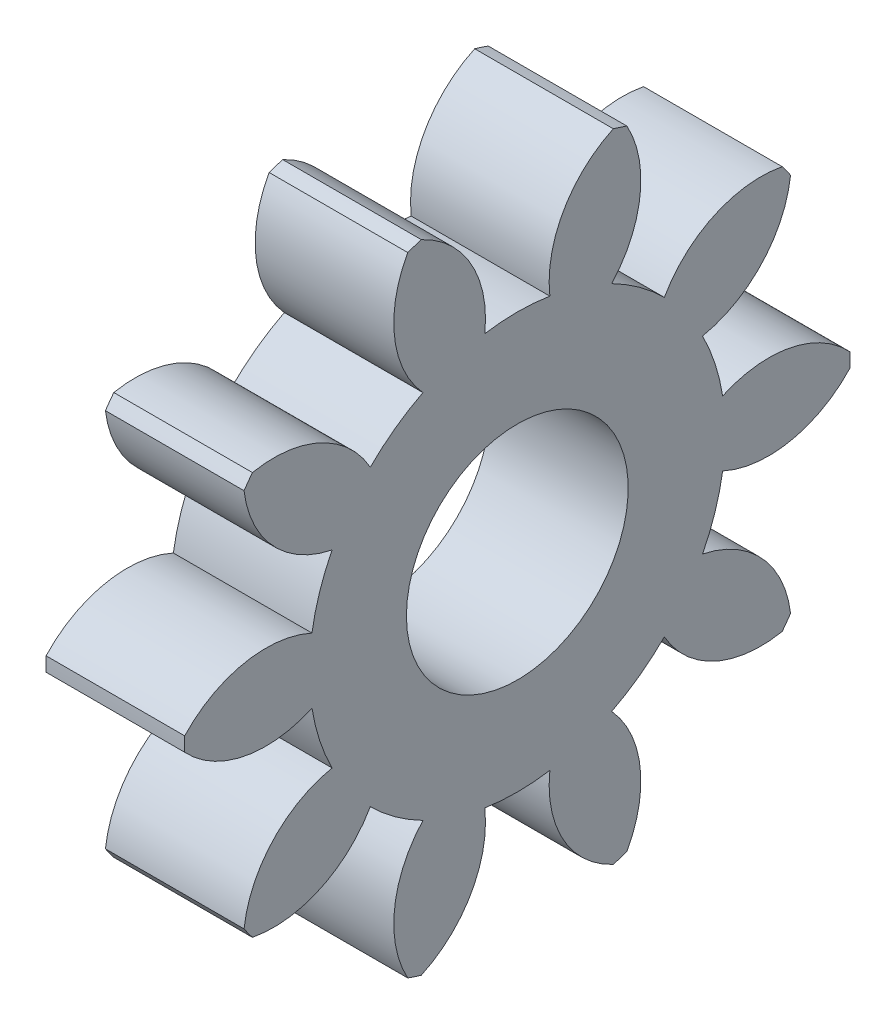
from build123d import *

# Parameters (mm, degrees)
BASPROSKE_W     = 5
BASPROSKE_H     = 12
TOOTHCUT_DEPTH  = 18.691806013
TEETHCUTS_COUNT = 10
TEETHCUTS_ANGLE = 324
BORSKE_R        = 4
BORE_DEPTH      = 50.0000508


with BuildPart() as part:
    # BasProSke → Base-Revolve (revolve)
    with BuildSketch(Plane(origin=(0, 0, 0), x_dir=(1, 0, 0), z_dir=(0, 1, 0)), mode=Mode.PRIVATE) as base_revolve_sk:
        with Locations((2.5, 6)):
            Rectangle(BASPROSKE_W, BASPROSKE_H)
    revolve(base_revolve_sk.sketch.rotate(Axis((-10, 0, 0), (1, 0, 0)), 180), axis=Axis((-10, 0, 0), (1, 0, 0)))

    # TooCutSke → ToothCut (cut, through all)
    with BuildSketch(Plane(origin=(0, 0, 0), x_dir=(0, 0, -1), z_dir=(1, 0, 0))):
        with BuildLine():
            ThreePointArc((1.173662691, 7.406586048), (0, 7.499), (-1.173662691, 7.406586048))
            ThreePointArc((-1.173662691, 7.406586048), (-1.668191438, 9.834565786), (-3.497907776, 11.50542856))
            ThreePointArc((-3.497907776, 11.50542856), (0, 12.0254), (3.497907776, 11.50542856))
            ThreePointArc((3.497907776, 11.50542856), (1.668191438, 9.834565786), (1.173662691, 7.406586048))
        make_face()
    toothcut = extrude(amount=TOOTHCUT_DEPTH, mode=Mode.SUBTRACT)

    # TeethCuts: ToothCut ×10 about axis
    teethcuts_axis = Axis((-10, 0, 0), (1, 0, 0))
    for i in range(1, TEETHCUTS_COUNT):
        add(toothcut.rotate(teethcuts_axis, i * TEETHCUTS_ANGLE / (TEETHCUTS_COUNT - 1)), mode=Mode.SUBTRACT)

    # BorSke → Bore (cut, symmetric)
    with BuildSketch(Plane(origin=(0, 0, 0), x_dir=(0, 0, -1), z_dir=(1, 0, 0))):
        with Locations(Location((0, 0, 0), (0, 0, 180))):
            Circle(BORSKE_R)
    extrude(amount=BORE_DEPTH, both=True, mode=Mode.SUBTRACT)


solid = part.part
